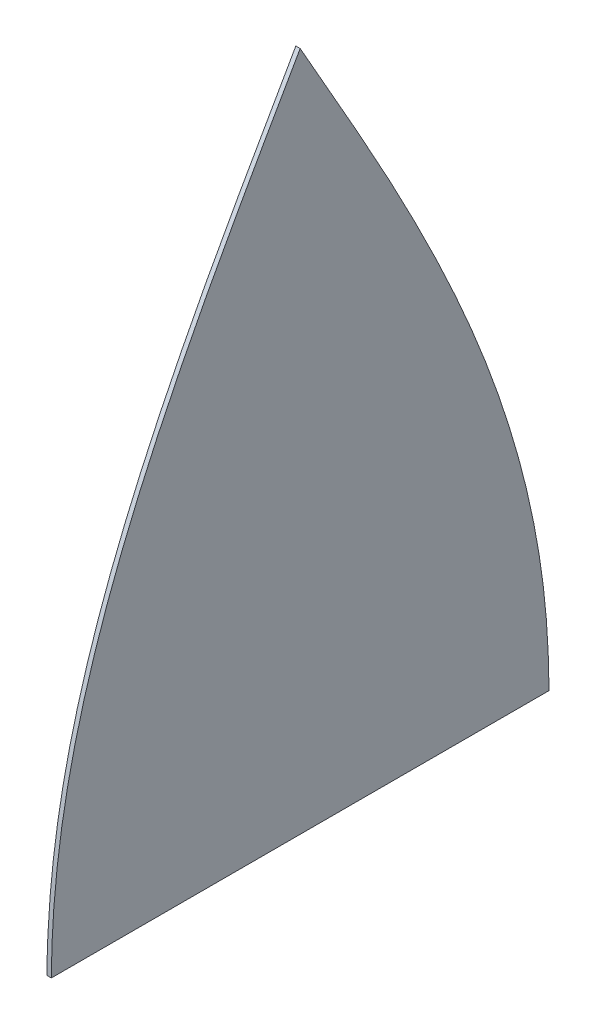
ISO-10303-21;
HEADER;
FILE_DESCRIPTION(('STEP AP214'),'2;1');
FILE_NAME('part.step','',(''),(''),'','','');
FILE_SCHEMA(('AUTOMOTIVE_DESIGN { 1 0 10303 214 1 1 1 1 }'));
ENDSEC;
DATA;
#1=APPLICATION_CONTEXT('core data for automotive mechanical design processes');
#2=APPLICATION_PROTOCOL_DEFINITION('international standard','automotive_design',2000,#1);
#3=PRODUCT_CONTEXT('',#1,'mechanical');
#4=PRODUCT('Part','Part','',(#3));
#5=PRODUCT_RELATED_PRODUCT_CATEGORY('part','',(#4));
#6=PRODUCT_DEFINITION_FORMATION('','',#4);
#7=PRODUCT_DEFINITION_CONTEXT('part definition',#1,'design');
#8=PRODUCT_DEFINITION('design','',#6,#7);
#9=PRODUCT_DEFINITION_SHAPE('','',#8);
#10=(LENGTH_UNIT() NAMED_UNIT(*) SI_UNIT(.MILLI.,.METRE.));
#11=(NAMED_UNIT(*) PLANE_ANGLE_UNIT() SI_UNIT($,.RADIAN.));
#12=(NAMED_UNIT(*) SI_UNIT($,.STERADIAN.) SOLID_ANGLE_UNIT());
#13=UNCERTAINTY_MEASURE_WITH_UNIT(LENGTH_MEASURE(1.E-05),#10,'distance_accuracy_value','');
#14=(GEOMETRIC_REPRESENTATION_CONTEXT(3) GLOBAL_UNCERTAINTY_ASSIGNED_CONTEXT((#13)) GLOBAL_UNIT_ASSIGNED_CONTEXT((#10,
#11,#12)) REPRESENTATION_CONTEXT('',''));
#15=CARTESIAN_POINT('',(0.,0.,0.));
#16=DIRECTION('',(0.,0.,1.));
#17=DIRECTION('',(1.,0.,0.));
#18=AXIS2_PLACEMENT_3D('',#15,#16,#17);
#19=CARTESIAN_POINT('',(99.,156.294234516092,0.));
#20=CARTESIAN_POINT('',(99.,142.012791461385,-8.20396050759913));
#21=CARTESIAN_POINT('',(99.,130.841362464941,-14.4994289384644));
#22=CARTESIAN_POINT('',(99.,121.772270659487,-19.4347773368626));
#23=CARTESIAN_POINT('',(99.,120.813187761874,-19.95332919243));
#24=CARTESIAN_POINT('',(99.,119.675076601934,-20.5642437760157));
#25=CARTESIAN_POINT('',(99.,119.451144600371,-20.6841970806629));
#26=CARTESIAN_POINT('',(99.,119.002556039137,-20.9241846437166));
#27=CARTESIAN_POINT('',(99.,118.778596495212,-21.0438284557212));
#28=CARTESIAN_POINT('',(99.,118.107722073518,-21.4017099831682));
#29=CARTESIAN_POINT('',(99.,117.661811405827,-21.6388977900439));
#30=CARTESIAN_POINT('',(99.,115.438952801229,-22.8178374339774));
#31=CARTESIAN_POINT('',(99.,113.682089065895,-23.7385910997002));
#32=CARTESIAN_POINT('',(99.,108.475767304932,-26.4336579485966));
#33=CARTESIAN_POINT('',(99.,105.090578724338,-28.1407769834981));
#34=CARTESIAN_POINT('',(99.,95.1920907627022,-32.9933574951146));
#35=CARTESIAN_POINT('',(99.,88.935869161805,-35.8700423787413));
#36=CARTESIAN_POINT('',(99.,82.2832365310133,-38.7031479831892));
#37=CARTESIAN_POINT('',(99.,81.5505779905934,-39.0118176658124));
#38=CARTESIAN_POINT('',(99.,80.0880806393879,-39.6214764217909));
#39=CARTESIAN_POINT('',(99.,79.3585945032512,-39.922308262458));
#40=CARTESIAN_POINT('',(99.,77.175423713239,-40.8128111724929));
#41=CARTESIAN_POINT('',(99.,75.7270266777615,-41.3904896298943));
#42=CARTESIAN_POINT('',(99.,71.402986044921,-43.0755545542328));
#43=CARTESIAN_POINT('',(99.,68.54849292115,-44.1349705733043));
#44=CARTESIAN_POINT('',(99.,60.0696154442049,-47.1213368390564));
#45=CARTESIAN_POINT('',(99.,54.5298329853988,-48.8564052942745));
#46=CARTESIAN_POINT('',(99.,47.746108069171,-50.7054378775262));
#47=CARTESIAN_POINT('',(99.,46.3964132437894,-51.059254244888));
#48=CARTESIAN_POINT('',(99.,43.7111239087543,-51.7349066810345));
#49=CARTESIAN_POINT('',(99.,42.3766093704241,-52.0564206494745));
#50=CARTESIAN_POINT('',(99.,38.3866052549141,-52.9752620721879));
#51=CARTESIAN_POINT('',(99.,35.7379121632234,-53.5289001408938));
#52=CARTESIAN_POINT('',(99.,30.4631452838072,-54.518330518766));
#53=CARTESIAN_POINT('',(99.,27.8370714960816,-54.9541228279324));
#54=CARTESIAN_POINT('',(99.,23.9149252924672,-55.5194269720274));
#55=CARTESIAN_POINT('',(99.,22.6103706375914,-55.6931309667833));
#56=CARTESIAN_POINT('',(99.,20.9832115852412,-55.8918475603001));
#57=CARTESIAN_POINT('',(99.,20.6578584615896,-55.9306714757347));
#58=CARTESIAN_POINT('',(99.,20.0029417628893,-56.0065369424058));
#59=CARTESIAN_POINT('',(99.,19.6739457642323,-56.0435711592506));
#60=CARTESIAN_POINT('',(99.,18.6823448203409,-56.151978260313));
#61=CARTESIAN_POINT('',(99.,18.0151269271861,-56.2206555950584));
#62=CARTESIAN_POINT('',(99.,11.9548105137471,-56.8064050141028));
#63=CARTESIAN_POINT('',(99.,6.17422436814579,-57.0970509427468));
#64=CARTESIAN_POINT('',(99.,0.,-57.157676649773));
#65=CARTESIAN_POINT('',(100.,156.294234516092,0.));
#66=CARTESIAN_POINT('',(100.,142.012791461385,-8.20396050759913));
#67=CARTESIAN_POINT('',(100.,130.841362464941,-14.4994289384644));
#68=CARTESIAN_POINT('',(100.,121.772270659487,-19.4347773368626));
#69=CARTESIAN_POINT('',(100.,120.813187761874,-19.95332919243));
#70=CARTESIAN_POINT('',(100.,119.675076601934,-20.5642437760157));
#71=CARTESIAN_POINT('',(100.,119.451144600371,-20.6841970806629));
#72=CARTESIAN_POINT('',(100.,119.002556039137,-20.9241846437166));
#73=CARTESIAN_POINT('',(100.,118.778596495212,-21.0438284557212));
#74=CARTESIAN_POINT('',(100.,118.107722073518,-21.4017099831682));
#75=CARTESIAN_POINT('',(100.,117.661811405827,-21.6388977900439));
#76=CARTESIAN_POINT('',(100.,115.438952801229,-22.8178374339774));
#77=CARTESIAN_POINT('',(100.,113.682089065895,-23.7385910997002));
#78=CARTESIAN_POINT('',(100.,108.475767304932,-26.4336579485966));
#79=CARTESIAN_POINT('',(100.,105.090578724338,-28.1407769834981));
#80=CARTESIAN_POINT('',(100.,95.1920907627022,-32.9933574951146));
#81=CARTESIAN_POINT('',(100.,88.935869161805,-35.8700423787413));
#82=CARTESIAN_POINT('',(100.,82.2832365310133,-38.7031479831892));
#83=CARTESIAN_POINT('',(100.,81.5505779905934,-39.0118176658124));
#84=CARTESIAN_POINT('',(100.,80.0880806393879,-39.6214764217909));
#85=CARTESIAN_POINT('',(100.,79.3585945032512,-39.922308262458));
#86=CARTESIAN_POINT('',(100.,77.175423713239,-40.8128111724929));
#87=CARTESIAN_POINT('',(100.,75.7270266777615,-41.3904896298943));
#88=CARTESIAN_POINT('',(100.,71.402986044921,-43.0755545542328));
#89=CARTESIAN_POINT('',(100.,68.54849292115,-44.1349705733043));
#90=CARTESIAN_POINT('',(100.,60.0696154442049,-47.1213368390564));
#91=CARTESIAN_POINT('',(100.,54.5298329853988,-48.8564052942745));
#92=CARTESIAN_POINT('',(100.,47.746108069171,-50.7054378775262));
#93=CARTESIAN_POINT('',(100.,46.3964132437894,-51.059254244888));
#94=CARTESIAN_POINT('',(100.,43.7111239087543,-51.7349066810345));
#95=CARTESIAN_POINT('',(100.,42.3766093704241,-52.0564206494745));
#96=CARTESIAN_POINT('',(100.,38.3866052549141,-52.9752620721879));
#97=CARTESIAN_POINT('',(100.,35.7379121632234,-53.5289001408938));
#98=CARTESIAN_POINT('',(100.,30.4631452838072,-54.518330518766));
#99=CARTESIAN_POINT('',(100.,27.8370714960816,-54.9541228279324));
#100=CARTESIAN_POINT('',(100.,23.9149252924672,-55.5194269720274));
#101=CARTESIAN_POINT('',(100.,22.6103706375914,-55.6931309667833));
#102=CARTESIAN_POINT('',(100.,20.9832115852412,-55.8918475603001));
#103=CARTESIAN_POINT('',(100.,20.6578584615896,-55.9306714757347));
#104=CARTESIAN_POINT('',(100.,20.0029417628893,-56.0065369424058));
#105=CARTESIAN_POINT('',(100.,19.6739457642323,-56.0435711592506));
#106=CARTESIAN_POINT('',(100.,18.6823448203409,-56.151978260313));
#107=CARTESIAN_POINT('',(100.,18.0151269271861,-56.2206555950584));
#108=CARTESIAN_POINT('',(100.,11.9548105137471,-56.8064050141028));
#109=CARTESIAN_POINT('',(100.,6.1742243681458,-57.0970509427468));
#110=CARTESIAN_POINT('',(100.,0.,-57.157676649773));
#111=B_SPLINE_SURFACE_WITH_KNOTS('',1,3,((#19,#20,#21,#22,#23,#24,#25,#26,#27,#28,#29,#30,#31,
#32,#33,#34,#35,#36,#37,#38,#39,#40,#41,#42,#43,#44,#45,#46,#47,#48,#49,#50,#51,#52,#53,#54,#55,
#56,#57,#58,#59,#60,#61,#62,#63,#64),(#65,#66,#67,#68,#69,#70,#71,#72,#73,#74,#75,#76,#77,#78,
#79,#80,#81,#82,#83,#84,#85,#86,#87,#88,#89,#90,#91,#92,#93,#94,#95,#96,#97,#98,#99,#100,#101,
#102,#103,#104,#105,#106,#107,#108,#109,#110)),.UNSPECIFIED.,.F.,.F.,.F.,(2,2),(4,2,2,2,2,2,2,2,
2,2,2,2,2,2,2,2,2,2,2,2,2,2,4),(0.,1.),(0.,0.125,0.140625,0.14453125,0.1484375,0.15625,0.1875,
0.25,0.375,0.390625,0.40625,0.4375,0.5,0.625,0.65625,0.6875,0.75,0.8125,0.84375,0.8515625,
0.859375,0.875,1.),.UNSPECIFIED.);
#112=DIRECTION('',(-1.,0.,0.));
#113=VECTOR('',#112,1.);
#114=CARTESIAN_POINT('',(99.5,156.294234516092,0.));
#115=LINE('',#114,#113);
#116=CARTESIAN_POINT('',(100.,156.294234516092,0.));
#117=VERTEX_POINT('',#116);
#118=CARTESIAN_POINT('',(99.,156.294234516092,0.));
#119=VERTEX_POINT('',#118);
#120=EDGE_CURVE('E13',#117,#119,#115,.T.);
#121=CARTESIAN_POINT('',(100.,156.294234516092,0.));
#122=CARTESIAN_POINT('',(100.,142.012791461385,-8.20396050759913));
#123=CARTESIAN_POINT('',(100.,130.841362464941,-14.4994289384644));
#124=CARTESIAN_POINT('',(100.,121.772270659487,-19.4347773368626));
#125=CARTESIAN_POINT('',(100.,120.813187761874,-19.95332919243));
#126=CARTESIAN_POINT('',(100.,119.675076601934,-20.5642437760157));
#127=CARTESIAN_POINT('',(100.,119.451144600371,-20.6841970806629));
#128=CARTESIAN_POINT('',(100.,119.002556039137,-20.9241846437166));
#129=CARTESIAN_POINT('',(100.,118.778596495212,-21.0438284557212));
#130=CARTESIAN_POINT('',(100.,118.107722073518,-21.4017099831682));
#131=CARTESIAN_POINT('',(100.,117.661811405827,-21.6388977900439));
#132=CARTESIAN_POINT('',(100.,115.438952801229,-22.8178374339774));
#133=CARTESIAN_POINT('',(100.,113.682089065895,-23.7385910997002));
#134=CARTESIAN_POINT('',(100.,108.475767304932,-26.4336579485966));
#135=CARTESIAN_POINT('',(100.,105.090578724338,-28.1407769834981));
#136=CARTESIAN_POINT('',(100.,95.1920907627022,-32.9933574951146));
#137=CARTESIAN_POINT('',(100.,88.935869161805,-35.8700423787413));
#138=CARTESIAN_POINT('',(100.,82.2832365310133,-38.7031479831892));
#139=CARTESIAN_POINT('',(100.,81.5505779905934,-39.0118176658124));
#140=CARTESIAN_POINT('',(100.,80.0880806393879,-39.6214764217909));
#141=CARTESIAN_POINT('',(100.,79.3585945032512,-39.922308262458));
#142=CARTESIAN_POINT('',(100.,77.175423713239,-40.8128111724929));
#143=CARTESIAN_POINT('',(100.,75.7270266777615,-41.3904896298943));
#144=CARTESIAN_POINT('',(100.,71.402986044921,-43.0755545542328));
#145=CARTESIAN_POINT('',(100.,68.54849292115,-44.1349705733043));
#146=CARTESIAN_POINT('',(100.,60.0696154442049,-47.1213368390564));
#147=CARTESIAN_POINT('',(100.,54.5298329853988,-48.8564052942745));
#148=CARTESIAN_POINT('',(100.,47.746108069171,-50.7054378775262));
#149=CARTESIAN_POINT('',(100.,46.3964132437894,-51.059254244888));
#150=CARTESIAN_POINT('',(100.,43.7111239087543,-51.7349066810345));
#151=CARTESIAN_POINT('',(100.,42.3766093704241,-52.0564206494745));
#152=CARTESIAN_POINT('',(100.,38.3866052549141,-52.9752620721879));
#153=CARTESIAN_POINT('',(100.,35.7379121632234,-53.5289001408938));
#154=CARTESIAN_POINT('',(100.,30.4631452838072,-54.518330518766));
#155=CARTESIAN_POINT('',(100.,27.8370714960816,-54.9541228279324));
#156=CARTESIAN_POINT('',(100.,23.9149252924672,-55.5194269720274));
#157=CARTESIAN_POINT('',(100.,22.6103706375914,-55.6931309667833));
#158=CARTESIAN_POINT('',(100.,20.9832115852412,-55.8918475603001));
#159=CARTESIAN_POINT('',(100.,20.6578584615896,-55.9306714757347));
#160=CARTESIAN_POINT('',(100.,20.0029417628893,-56.0065369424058));
#161=CARTESIAN_POINT('',(100.,19.6739457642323,-56.0435711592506));
#162=CARTESIAN_POINT('',(100.,18.6823448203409,-56.151978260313));
#163=CARTESIAN_POINT('',(100.,18.0151269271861,-56.2206555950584));
#164=CARTESIAN_POINT('',(100.,11.9548105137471,-56.8064050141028));
#165=CARTESIAN_POINT('',(100.,6.1742243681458,-57.0970509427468));
#166=CARTESIAN_POINT('',(100.,0.,-57.157676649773));
#167=B_SPLINE_CURVE_WITH_KNOTS('',3,(#121,#122,#123,#124,#125,#126,#127,#128,#129,#130,#131,
#132,#133,#134,#135,#136,#137,#138,#139,#140,#141,#142,#143,#144,#145,#146,#147,#148,#149,#150,
#151,#152,#153,#154,#155,#156,#157,#158,#159,#160,#161,#162,#163,#164,#165,#166),.UNSPECIFIED.,
.F.,.F.,(4,2,2,2,2,2,2,2,2,2,2,2,2,2,2,2,2,2,2,2,2,2,4),(0.,0.125,0.140625,0.14453125,0.1484375,
0.15625,0.1875,0.25,0.375,0.390625,0.40625,0.4375,0.5,0.625,0.65625,0.6875,0.75,0.8125,0.84375,
0.8515625,0.859375,0.875,1.),.UNSPECIFIED.);
#168=CARTESIAN_POINT('',(100.,0.,-57.157676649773));
#169=VERTEX_POINT('',#168);
#170=EDGE_CURVE('E87',#117,#169,#167,.T.);
#171=DIRECTION('',(-1.,0.,0.));
#172=VECTOR('',#171,1.);
#173=CARTESIAN_POINT('',(99.,0.,-57.157676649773));
#174=LINE('',#173,#172);
#175=CARTESIAN_POINT('',(99.,0.,-57.157676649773));
#176=VERTEX_POINT('',#175);
#177=EDGE_CURVE('E63',#169,#176,#174,.T.);
#178=CARTESIAN_POINT('',(99.,0.,-57.157676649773));
#179=CARTESIAN_POINT('',(99.,6.17422436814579,-57.0970509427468));
#180=CARTESIAN_POINT('',(99.,11.9548105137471,-56.8064050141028));
#181=CARTESIAN_POINT('',(99.,18.0151269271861,-56.2206555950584));
#182=CARTESIAN_POINT('',(99.,18.6823448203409,-56.151978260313));
#183=CARTESIAN_POINT('',(99.,19.6739457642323,-56.0435711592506));
#184=CARTESIAN_POINT('',(99.,20.0029417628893,-56.0065369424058));
#185=CARTESIAN_POINT('',(99.,20.6578584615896,-55.9306714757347));
#186=CARTESIAN_POINT('',(99.,20.9832115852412,-55.8918475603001));
#187=CARTESIAN_POINT('',(99.,22.6103706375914,-55.6931309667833));
#188=CARTESIAN_POINT('',(99.,23.9149252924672,-55.5194269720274));
#189=CARTESIAN_POINT('',(99.,27.8370714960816,-54.9541228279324));
#190=CARTESIAN_POINT('',(99.,30.4631452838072,-54.518330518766));
#191=CARTESIAN_POINT('',(99.,35.7379121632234,-53.5289001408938));
#192=CARTESIAN_POINT('',(99.,38.3866052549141,-52.9752620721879));
#193=CARTESIAN_POINT('',(99.,42.3766093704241,-52.0564206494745));
#194=CARTESIAN_POINT('',(99.,43.7111239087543,-51.7349066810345));
#195=CARTESIAN_POINT('',(99.,46.3964132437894,-51.059254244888));
#196=CARTESIAN_POINT('',(99.,47.746108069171,-50.7054378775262));
#197=CARTESIAN_POINT('',(99.,54.5298329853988,-48.8564052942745));
#198=CARTESIAN_POINT('',(99.,60.0696154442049,-47.1213368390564));
#199=CARTESIAN_POINT('',(99.,68.54849292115,-44.1349705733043));
#200=CARTESIAN_POINT('',(99.,71.402986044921,-43.0755545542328));
#201=CARTESIAN_POINT('',(99.,75.7270266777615,-41.3904896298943));
#202=CARTESIAN_POINT('',(99.,77.175423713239,-40.8128111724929));
#203=CARTESIAN_POINT('',(99.,79.3585945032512,-39.922308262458));
#204=CARTESIAN_POINT('',(99.,80.0880806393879,-39.6214764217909));
#205=CARTESIAN_POINT('',(99.,81.5505779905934,-39.0118176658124));
#206=CARTESIAN_POINT('',(99.,82.2832365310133,-38.7031479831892));
#207=CARTESIAN_POINT('',(99.,88.935869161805,-35.8700423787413));
#208=CARTESIAN_POINT('',(99.,95.1920907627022,-32.9933574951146));
#209=CARTESIAN_POINT('',(99.,105.090578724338,-28.1407769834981));
#210=CARTESIAN_POINT('',(99.,108.475767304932,-26.4336579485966));
#211=CARTESIAN_POINT('',(99.,113.682089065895,-23.7385910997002));
#212=CARTESIAN_POINT('',(99.,115.438952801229,-22.8178374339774));
#213=CARTESIAN_POINT('',(99.,117.661811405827,-21.6388977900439));
#214=CARTESIAN_POINT('',(99.,118.107722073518,-21.4017099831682));
#215=CARTESIAN_POINT('',(99.,118.778596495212,-21.0438284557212));
#216=CARTESIAN_POINT('',(99.,119.002556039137,-20.9241846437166));
#217=CARTESIAN_POINT('',(99.,119.451144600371,-20.6841970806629));
#218=CARTESIAN_POINT('',(99.,119.675076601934,-20.5642437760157));
#219=CARTESIAN_POINT('',(99.,120.813187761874,-19.95332919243));
#220=CARTESIAN_POINT('',(99.,121.772270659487,-19.4347773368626));
#221=CARTESIAN_POINT('',(99.,130.841362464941,-14.4994289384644));
#222=CARTESIAN_POINT('',(99.,142.012791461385,-8.20396050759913));
#223=CARTESIAN_POINT('',(99.,156.294234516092,0.));
#224=B_SPLINE_CURVE_WITH_KNOTS('',3,(#178,#179,#180,#181,#182,#183,#184,#185,#186,#187,#188,
#189,#190,#191,#192,#193,#194,#195,#196,#197,#198,#199,#200,#201,#202,#203,#204,#205,#206,#207,
#208,#209,#210,#211,#212,#213,#214,#215,#216,#217,#218,#219,#220,#221,#222,#223),.UNSPECIFIED.,
.F.,.F.,(4,2,2,2,2,2,2,2,2,2,2,2,2,2,2,2,2,2,2,2,2,2,4),(0.,0.125,0.140625,0.1484375,0.15625,
0.1875,0.25,0.3125,0.34375,0.375,0.5,0.5625,0.59375,0.609375,0.625,0.75,0.8125,0.84375,
0.8515625,0.85546875,0.859375,0.875,1.),.UNSPECIFIED.);
#225=EDGE_CURVE('E90',#119,#176,#224,.F.);
#226=ORIENTED_EDGE('',*,*,#120,.F.);
#227=ORIENTED_EDGE('',*,*,#170,.T.);
#228=ORIENTED_EDGE('',*,*,#177,.T.);
#229=ORIENTED_EDGE('',*,*,#225,.F.);
#230=EDGE_LOOP('',(#226,#227,#228,#229));
#231=FACE_BOUND('',#230,.T.);
#232=ADVANCED_FACE('F50',(#231),#111,.T.);
#233=CARTESIAN_POINT('',(99.,0.,57.157676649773));
#234=DIRECTION('',(0.,-1.,0.));
#235=DIRECTION('',(0.,0.,1.));
#236=AXIS2_PLACEMENT_3D('',#233,#234,#235);
#237=PLANE('',#236);
#238=ORIENTED_EDGE('',*,*,#177,.F.);
#239=DIRECTION('',(0.,0.,1.));
#240=VECTOR('',#239,1.);
#241=CARTESIAN_POINT('',(100.,0.,0.));
#242=LINE('',#241,#240);
#243=CARTESIAN_POINT('',(100.,0.,57.157676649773));
#244=VERTEX_POINT('',#243);
#245=EDGE_CURVE('E103',#169,#244,#242,.T.);
#246=ORIENTED_EDGE('',*,*,#245,.T.);
#247=DIRECTION('',(-1.,0.,0.));
#248=VECTOR('',#247,1.);
#249=CARTESIAN_POINT('',(99.,0.,57.157676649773));
#250=LINE('',#249,#248);
#251=CARTESIAN_POINT('',(99.,0.,57.157676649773));
#252=VERTEX_POINT('',#251);
#253=EDGE_CURVE('E72',#244,#252,#250,.T.);
#254=ORIENTED_EDGE('',*,*,#253,.T.);
#255=DIRECTION('',(0.,0.,1.));
#256=VECTOR('',#255,1.);
#257=CARTESIAN_POINT('',(99.,0.,57.157676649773));
#258=LINE('',#257,#256);
#259=EDGE_CURVE('E125',#176,#252,#258,.T.);
#260=ORIENTED_EDGE('',*,*,#259,.F.);
#261=EDGE_LOOP('',(#238,#246,#254,#260));
#262=FACE_BOUND('',#261,.T.);
#263=ADVANCED_FACE('F148',(#262),#237,.T.);
#264=CARTESIAN_POINT('',(99.,0.,57.157676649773));
#265=CARTESIAN_POINT('',(99.,10.9189677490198,57.0958552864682));
#266=CARTESIAN_POINT('',(99.,21.7575269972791,56.0838459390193));
#267=CARTESIAN_POINT('',(99.,35.2052154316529,53.631099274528));
#268=CARTESIAN_POINT('',(99.,37.8897275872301,53.0811631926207));
#269=CARTESIAN_POINT('',(99.,41.2390858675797,52.3195096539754));
#270=CARTESIAN_POINT('',(99.,41.9079939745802,52.1635697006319));
#271=CARTESIAN_POINT('',(99.,43.2499867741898,51.8435086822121));
#272=CARTESIAN_POINT('',(99.,43.9227575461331,51.6794371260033));
#273=CARTESIAN_POINT('',(99.,45.9463929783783,51.1750993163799));
#274=CARTESIAN_POINT('',(99.,47.3025807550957,50.8227099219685));
#275=CARTESIAN_POINT('',(99.,54.1190070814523,48.9799420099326));
#276=CARTESIAN_POINT('',(99.,59.6857079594,47.247100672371));
#277=CARTESIAN_POINT('',(99.,68.2060990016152,44.2598981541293));
#278=CARTESIAN_POINT('',(99.,71.0746193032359,43.1995072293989));
#279=CARTESIAN_POINT('',(99.,75.4199846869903,41.5119357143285));
#280=CARTESIAN_POINT('',(99.,76.8755373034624,40.9332476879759));
#281=CARTESIAN_POINT('',(99.,79.0695124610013,40.0409693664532));
#282=CARTESIAN_POINT('',(99.,79.8026118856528,39.7395022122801));
#283=CARTESIAN_POINT('',(99.,81.2723594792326,39.1284858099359));
#284=CARTESIAN_POINT('',(99.,82.0080581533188,38.819358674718));
#285=CARTESIAN_POINT('',(99.,88.6856913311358,35.9828953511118));
#286=CARTESIAN_POINT('',(99.,94.9669886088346,33.0998000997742));
#287=CARTESIAN_POINT('',(99.,104.907369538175,28.2324654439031));
#288=CARTESIAN_POINT('',(99.,108.307235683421,26.519571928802));
#289=CARTESIAN_POINT('',(99.,113.536643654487,23.8145587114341));
#290=CARTESIAN_POINT('',(99.,115.301381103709,22.8902754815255));
#291=CARTESIAN_POINT('',(99.,117.534304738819,21.7066562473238));
#292=CARTESIAN_POINT('',(99.,117.98223955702,21.4685191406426));
#293=CARTESIAN_POINT('',(99.,118.656166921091,21.1091935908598));
#294=CARTESIAN_POINT('',(99.,118.881146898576,20.9890650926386));
#295=CARTESIAN_POINT('',(99.,119.331781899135,20.7481014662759));
#296=CARTESIAN_POINT('',(99.,119.556530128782,20.6277742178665));
#297=CARTESIAN_POINT('',(99.,120.695123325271,20.0169982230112));
#298=CARTESIAN_POINT('',(99.,121.65503645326,19.4982833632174));
#299=CARTESIAN_POINT('',(99.,130.735601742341,14.5590030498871));
#300=CARTESIAN_POINT('',(99.,141.945683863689,8.24251157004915));
#301=CARTESIAN_POINT('',(99.,156.294234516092,0.));
#302=CARTESIAN_POINT('',(100.,0.,57.157676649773));
#303=CARTESIAN_POINT('',(100.,10.9189677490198,57.0958552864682));
#304=CARTESIAN_POINT('',(100.,21.7575269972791,56.0838459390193));
#305=CARTESIAN_POINT('',(100.,35.2052154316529,53.631099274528));
#306=CARTESIAN_POINT('',(100.,37.8897275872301,53.0811631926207));
#307=CARTESIAN_POINT('',(100.,41.2390858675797,52.3195096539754));
#308=CARTESIAN_POINT('',(100.,41.9079939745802,52.1635697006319));
#309=CARTESIAN_POINT('',(100.,43.2499867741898,51.8435086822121));
#310=CARTESIAN_POINT('',(100.,43.9227575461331,51.6794371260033));
#311=CARTESIAN_POINT('',(100.,45.9463929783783,51.1750993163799));
#312=CARTESIAN_POINT('',(100.,47.3025807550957,50.8227099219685));
#313=CARTESIAN_POINT('',(100.,54.1190070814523,48.9799420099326));
#314=CARTESIAN_POINT('',(100.,59.6857079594,47.247100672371));
#315=CARTESIAN_POINT('',(100.,68.2060990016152,44.2598981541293));
#316=CARTESIAN_POINT('',(100.,71.0746193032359,43.1995072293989));
#317=CARTESIAN_POINT('',(100.,75.4199846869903,41.5119357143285));
#318=CARTESIAN_POINT('',(100.,76.8755373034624,40.9332476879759));
#319=CARTESIAN_POINT('',(100.,79.0695124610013,40.0409693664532));
#320=CARTESIAN_POINT('',(100.,79.8026118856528,39.7395022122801));
#321=CARTESIAN_POINT('',(100.,81.2723594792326,39.1284858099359));
#322=CARTESIAN_POINT('',(100.,82.0080581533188,38.819358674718));
#323=CARTESIAN_POINT('',(100.,88.6856913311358,35.9828953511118));
#324=CARTESIAN_POINT('',(100.,94.9669886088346,33.0998000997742));
#325=CARTESIAN_POINT('',(100.,104.907369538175,28.2324654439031));
#326=CARTESIAN_POINT('',(100.,108.307235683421,26.519571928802));
#327=CARTESIAN_POINT('',(100.,113.536643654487,23.8145587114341));
#328=CARTESIAN_POINT('',(100.,115.301381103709,22.8902754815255));
#329=CARTESIAN_POINT('',(100.,117.534304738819,21.7066562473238));
#330=CARTESIAN_POINT('',(100.,117.98223955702,21.4685191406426));
#331=CARTESIAN_POINT('',(100.,118.656166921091,21.1091935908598));
#332=CARTESIAN_POINT('',(100.,118.881146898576,20.9890650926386));
#333=CARTESIAN_POINT('',(100.,119.331781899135,20.7481014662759));
#334=CARTESIAN_POINT('',(100.,119.556530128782,20.6277742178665));
#335=CARTESIAN_POINT('',(100.,120.695123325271,20.0169982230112));
#336=CARTESIAN_POINT('',(100.,121.65503645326,19.4982833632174));
#337=CARTESIAN_POINT('',(100.,130.735601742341,14.5590030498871));
#338=CARTESIAN_POINT('',(100.,141.945683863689,8.24251157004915));
#339=CARTESIAN_POINT('',(100.,156.294234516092,0.));
#340=B_SPLINE_SURFACE_WITH_KNOTS('',1,3,((#264,#265,#266,#267,#268,#269,#270,#271,#272,#273,
#274,#275,#276,#277,#278,#279,#280,#281,#282,#283,#284,#285,#286,#287,#288,#289,#290,#291,#292,
#293,#294,#295,#296,#297,#298,#299,#300,#301),(#302,#303,#304,#305,#306,#307,#308,#309,#310,
#311,#312,#313,#314,#315,#316,#317,#318,#319,#320,#321,#322,#323,#324,#325,#326,#327,#328,#329,
#330,#331,#332,#333,#334,#335,#336,#337,#338,#339)),.UNSPECIFIED.,.F.,.F.,.F.,(2,2),(4,2,2,2,2,
2,2,2,2,2,2,2,2,2,2,2,2,2,4),(0.,1.),(0.,0.25,0.3125,0.328125,0.34375,0.375,0.5,0.5625,0.59375,
0.609375,0.625,0.75,0.8125,0.84375,0.8515625,0.85546875,0.859375,0.875,1.),.UNSPECIFIED.);
#341=CARTESIAN_POINT('',(100.,0.,57.157676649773));
#342=CARTESIAN_POINT('',(100.,10.9189677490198,57.0958552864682));
#343=CARTESIAN_POINT('',(100.,21.7575269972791,56.0838459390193));
#344=CARTESIAN_POINT('',(100.,35.2052154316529,53.631099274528));
#345=CARTESIAN_POINT('',(100.,37.8897275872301,53.0811631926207));
#346=CARTESIAN_POINT('',(100.,41.2390858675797,52.3195096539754));
#347=CARTESIAN_POINT('',(100.,41.9079939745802,52.1635697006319));
#348=CARTESIAN_POINT('',(100.,43.2499867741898,51.8435086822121));
#349=CARTESIAN_POINT('',(100.,43.9227575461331,51.6794371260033));
#350=CARTESIAN_POINT('',(100.,45.9463929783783,51.1750993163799));
#351=CARTESIAN_POINT('',(100.,47.3025807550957,50.8227099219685));
#352=CARTESIAN_POINT('',(100.,54.1190070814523,48.9799420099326));
#353=CARTESIAN_POINT('',(100.,59.6857079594,47.247100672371));
#354=CARTESIAN_POINT('',(100.,68.2060990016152,44.2598981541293));
#355=CARTESIAN_POINT('',(100.,71.0746193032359,43.1995072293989));
#356=CARTESIAN_POINT('',(100.,75.4199846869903,41.5119357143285));
#357=CARTESIAN_POINT('',(100.,76.8755373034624,40.9332476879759));
#358=CARTESIAN_POINT('',(100.,79.0695124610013,40.0409693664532));
#359=CARTESIAN_POINT('',(100.,79.8026118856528,39.7395022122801));
#360=CARTESIAN_POINT('',(100.,81.2723594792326,39.1284858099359));
#361=CARTESIAN_POINT('',(100.,82.0080581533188,38.819358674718));
#362=CARTESIAN_POINT('',(100.,88.6856913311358,35.9828953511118));
#363=CARTESIAN_POINT('',(100.,94.9669886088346,33.0998000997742));
#364=CARTESIAN_POINT('',(100.,104.907369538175,28.2324654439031));
#365=CARTESIAN_POINT('',(100.,108.307235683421,26.519571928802));
#366=CARTESIAN_POINT('',(100.,113.536643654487,23.8145587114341));
#367=CARTESIAN_POINT('',(100.,115.301381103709,22.8902754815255));
#368=CARTESIAN_POINT('',(100.,117.534304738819,21.7066562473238));
#369=CARTESIAN_POINT('',(100.,117.98223955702,21.4685191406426));
#370=CARTESIAN_POINT('',(100.,118.656166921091,21.1091935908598));
#371=CARTESIAN_POINT('',(100.,118.881146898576,20.9890650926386));
#372=CARTESIAN_POINT('',(100.,119.331781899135,20.7481014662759));
#373=CARTESIAN_POINT('',(100.,119.556530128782,20.6277742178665));
#374=CARTESIAN_POINT('',(100.,120.695123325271,20.0169982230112));
#375=CARTESIAN_POINT('',(100.,121.65503645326,19.4982833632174));
#376=CARTESIAN_POINT('',(100.,130.735601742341,14.5590030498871));
#377=CARTESIAN_POINT('',(100.,141.945683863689,8.24251157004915));
#378=CARTESIAN_POINT('',(100.,156.294234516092,0.));
#379=B_SPLINE_CURVE_WITH_KNOTS('',3,(#341,#342,#343,#344,#345,#346,#347,#348,#349,#350,#351,
#352,#353,#354,#355,#356,#357,#358,#359,#360,#361,#362,#363,#364,#365,#366,#367,#368,#369,#370,
#371,#372,#373,#374,#375,#376,#377,#378),.UNSPECIFIED.,.F.,.F.,(4,2,2,2,2,2,2,2,2,2,2,2,2,2,2,2,
2,2,4),(0.,0.25,0.3125,0.328125,0.34375,0.375,0.5,0.5625,0.59375,0.609375,0.625,0.75,0.8125,
0.84375,0.8515625,0.85546875,0.859375,0.875,1.),.UNSPECIFIED.);
#380=EDGE_CURVE('E101',#244,#117,#379,.T.);
#381=CARTESIAN_POINT('',(99.,156.294234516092,0.));
#382=CARTESIAN_POINT('',(99.,141.945683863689,8.24251157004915));
#383=CARTESIAN_POINT('',(99.,130.735601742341,14.5590030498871));
#384=CARTESIAN_POINT('',(99.,121.65503645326,19.4982833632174));
#385=CARTESIAN_POINT('',(99.,120.695123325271,20.0169982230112));
#386=CARTESIAN_POINT('',(99.,119.556530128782,20.6277742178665));
#387=CARTESIAN_POINT('',(99.,119.331781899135,20.7481014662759));
#388=CARTESIAN_POINT('',(99.,118.881146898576,20.9890650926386));
#389=CARTESIAN_POINT('',(99.,118.656166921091,21.1091935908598));
#390=CARTESIAN_POINT('',(99.,117.98223955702,21.4685191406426));
#391=CARTESIAN_POINT('',(99.,117.534304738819,21.7066562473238));
#392=CARTESIAN_POINT('',(99.,115.301381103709,22.8902754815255));
#393=CARTESIAN_POINT('',(99.,113.536643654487,23.8145587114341));
#394=CARTESIAN_POINT('',(99.,108.307235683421,26.519571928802));
#395=CARTESIAN_POINT('',(99.,104.907369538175,28.2324654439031));
#396=CARTESIAN_POINT('',(99.,94.9669886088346,33.0998000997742));
#397=CARTESIAN_POINT('',(99.,88.6856913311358,35.9828953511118));
#398=CARTESIAN_POINT('',(99.,82.0080581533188,38.819358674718));
#399=CARTESIAN_POINT('',(99.,81.2723594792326,39.1284858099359));
#400=CARTESIAN_POINT('',(99.,79.8026118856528,39.7395022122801));
#401=CARTESIAN_POINT('',(99.,79.0695124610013,40.0409693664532));
#402=CARTESIAN_POINT('',(99.,76.8755373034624,40.9332476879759));
#403=CARTESIAN_POINT('',(99.,75.4199846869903,41.5119357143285));
#404=CARTESIAN_POINT('',(99.,71.0746193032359,43.1995072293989));
#405=CARTESIAN_POINT('',(99.,68.2060990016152,44.2598981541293));
#406=CARTESIAN_POINT('',(99.,59.6857079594,47.247100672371));
#407=CARTESIAN_POINT('',(99.,54.1190070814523,48.9799420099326));
#408=CARTESIAN_POINT('',(99.,47.3025807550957,50.8227099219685));
#409=CARTESIAN_POINT('',(99.,45.9463929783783,51.1750993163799));
#410=CARTESIAN_POINT('',(99.,43.9227575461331,51.6794371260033));
#411=CARTESIAN_POINT('',(99.,43.2499867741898,51.8435086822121));
#412=CARTESIAN_POINT('',(99.,41.9079939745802,52.1635697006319));
#413=CARTESIAN_POINT('',(99.,41.2390858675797,52.3195096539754));
#414=CARTESIAN_POINT('',(99.,37.8897275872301,53.0811631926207));
#415=CARTESIAN_POINT('',(99.,35.2052154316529,53.631099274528));
#416=CARTESIAN_POINT('',(99.,21.7575269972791,56.0838459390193));
#417=CARTESIAN_POINT('',(99.,10.9189677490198,57.0958552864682));
#418=CARTESIAN_POINT('',(99.,0.,57.157676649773));
#419=B_SPLINE_CURVE_WITH_KNOTS('',3,(#381,#382,#383,#384,#385,#386,#387,#388,#389,#390,#391,
#392,#393,#394,#395,#396,#397,#398,#399,#400,#401,#402,#403,#404,#405,#406,#407,#408,#409,#410,
#411,#412,#413,#414,#415,#416,#417,#418),.UNSPECIFIED.,.F.,.F.,(4,2,2,2,2,2,2,2,2,2,2,2,2,2,2,2,
2,2,4),(0.,0.125,0.140625,0.14453125,0.1484375,0.15625,0.1875,0.25,0.375,0.390625,0.40625,
0.4375,0.5,0.625,0.65625,0.671875,0.6875,0.75,1.),.UNSPECIFIED.);
#420=EDGE_CURVE('E124',#252,#119,#419,.F.);
#421=ORIENTED_EDGE('',*,*,#380,.T.);
#422=ORIENTED_EDGE('',*,*,#120,.T.);
#423=ORIENTED_EDGE('',*,*,#420,.F.);
#424=ORIENTED_EDGE('',*,*,#253,.F.);
#425=EDGE_LOOP('',(#421,#422,#423,#424));
#426=FACE_BOUND('',#425,.T.);
#427=ADVANCED_FACE('F52',(#426),#340,.T.);
#428=CARTESIAN_POINT('',(99.,78.1471172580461,0.));
#429=DIRECTION('',(-1.,0.,0.));
#430=DIRECTION('',(0.,-1.,0.));
#431=AXIS2_PLACEMENT_3D('',#428,#429,#430);
#432=PLANE('',#431);
#433=ORIENTED_EDGE('',*,*,#259,.T.);
#434=ORIENTED_EDGE('',*,*,#420,.T.);
#435=ORIENTED_EDGE('',*,*,#225,.T.);
#436=EDGE_LOOP('',(#433,#434,#435));
#437=FACE_BOUND('',#436,.T.);
#438=ADVANCED_FACE('F139',(#437),#432,.T.);
#439=CARTESIAN_POINT('',(100.,78.1471172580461,0.));
#440=DIRECTION('',(-1.,0.,0.));
#441=DIRECTION('',(0.,-1.,0.));
#442=AXIS2_PLACEMENT_3D('',#439,#440,#441);
#443=PLANE('',#442);
#444=ORIENTED_EDGE('',*,*,#245,.F.);
#445=ORIENTED_EDGE('',*,*,#170,.F.);
#446=ORIENTED_EDGE('',*,*,#380,.F.);
#447=EDGE_LOOP('',(#444,#445,#446));
#448=FACE_BOUND('',#447,.T.);
#449=ADVANCED_FACE('F100',(#448),#443,.F.);
#450=CLOSED_SHELL('',(#232,#263,#427,#438,#449));
#451=MANIFOLD_SOLID_BREP('B2',#450);
#452=ADVANCED_BREP_SHAPE_REPRESENTATION('',(#18,#451),#14);
#453=SHAPE_DEFINITION_REPRESENTATION(#9,#452);
ENDSEC;
END-ISO-10303-21;
